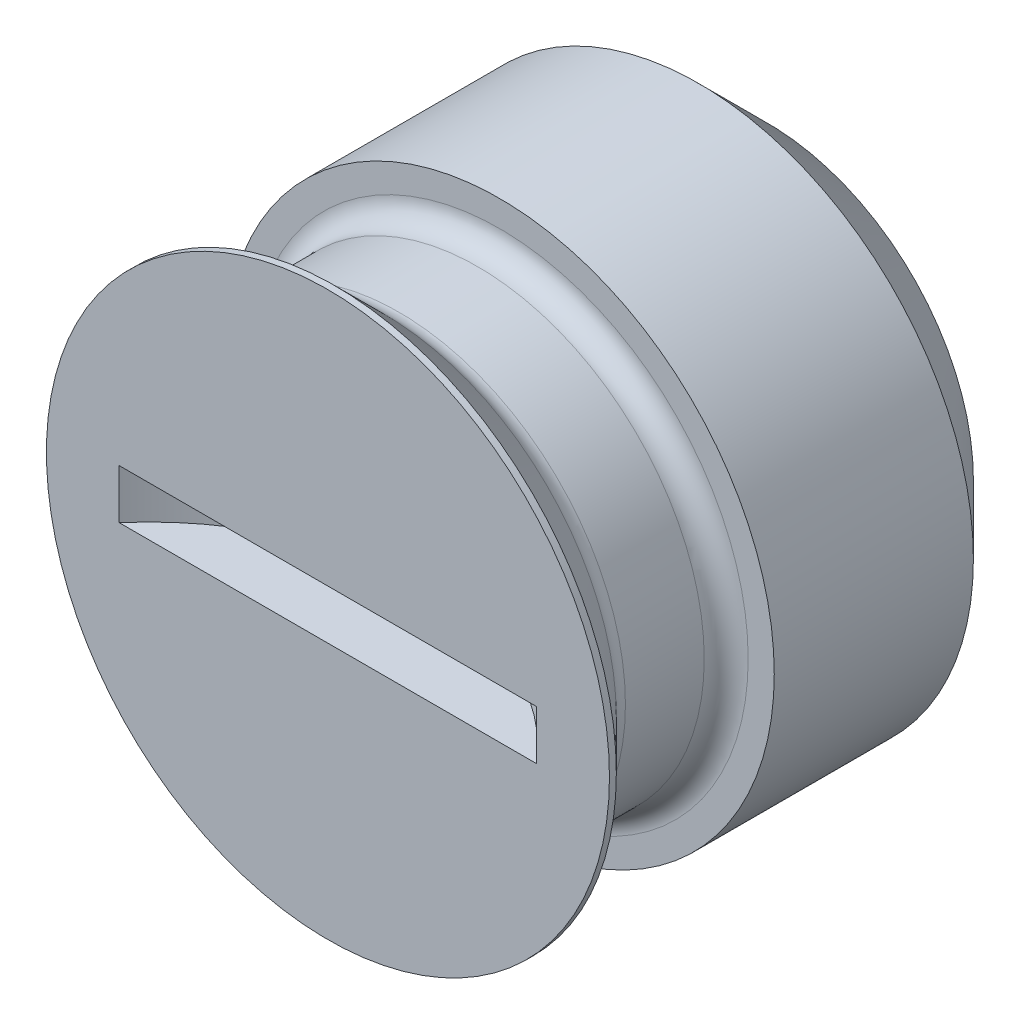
ISO-10303-21;
HEADER;
FILE_DESCRIPTION(('STEP AP214'),'2;1');
FILE_NAME('part.step','',(''),(''),'','','');
FILE_SCHEMA(('AUTOMOTIVE_DESIGN { 1 0 10303 214 1 1 1 1 }'));
ENDSEC;
DATA;
#1=APPLICATION_CONTEXT('core data for automotive mechanical design processes');
#2=APPLICATION_PROTOCOL_DEFINITION('international standard','automotive_design',2000,#1);
#3=PRODUCT_CONTEXT('',#1,'mechanical');
#4=PRODUCT('Part','Part','',(#3));
#5=PRODUCT_RELATED_PRODUCT_CATEGORY('part','',(#4));
#6=PRODUCT_DEFINITION_FORMATION('','',#4);
#7=PRODUCT_DEFINITION_CONTEXT('part definition',#1,'design');
#8=PRODUCT_DEFINITION('design','',#6,#7);
#9=PRODUCT_DEFINITION_SHAPE('','',#8);
#10=(LENGTH_UNIT() NAMED_UNIT(*) SI_UNIT(.MILLI.,.METRE.));
#11=(NAMED_UNIT(*) PLANE_ANGLE_UNIT() SI_UNIT($,.RADIAN.));
#12=(NAMED_UNIT(*) SI_UNIT($,.STERADIAN.) SOLID_ANGLE_UNIT());
#13=UNCERTAINTY_MEASURE_WITH_UNIT(LENGTH_MEASURE(1.E-05),#10,'distance_accuracy_value','');
#14=(GEOMETRIC_REPRESENTATION_CONTEXT(3) GLOBAL_UNCERTAINTY_ASSIGNED_CONTEXT((#13)) GLOBAL_UNIT_ASSIGNED_CONTEXT((#10,
#11,#12)) REPRESENTATION_CONTEXT('',''));
#15=CARTESIAN_POINT('',(0.,0.,0.));
#16=DIRECTION('',(0.,0.,1.));
#17=DIRECTION('',(1.,0.,0.));
#18=AXIS2_PLACEMENT_3D('',#15,#16,#17);
#19=CARTESIAN_POINT('',(0.,10.25,0.));
#20=DIRECTION('',(0.,0.,-1.));
#21=DIRECTION('',(-1.,0.,0.));
#22=AXIS2_PLACEMENT_3D('',#19,#20,#21);
#23=PLANE('',#22);
#24=CARTESIAN_POINT('',(0.,0.,0.));
#25=DIRECTION('',(0.,0.,1.));
#26=DIRECTION('',(1.,0.,0.));
#27=AXIS2_PLACEMENT_3D('',#24,#25,#26);
#28=CIRCLE('',#27,10.25);
#29=CARTESIAN_POINT('',(10.25,0.,0.));
#30=VERTEX_POINT('',#29);
#31=EDGE_CURVE('E76',#30,#30,#28,.T.);
#32=ORIENTED_EDGE('',*,*,#31,.T.);
#33=EDGE_LOOP('',(#32));
#34=FACE_BOUND('',#33,.T.);
#35=DIRECTION('',(1.,0.,0.));
#36=VECTOR('',#35,1.);
#37=CARTESIAN_POINT('',(0.,-0.9,0.));
#38=LINE('',#37,#36);
#39=CARTESIAN_POINT('',(-7.59934207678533,-0.9,0.));
#40=VERTEX_POINT('',#39);
#41=CARTESIAN_POINT('',(7.59934207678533,-0.9,0.));
#42=VERTEX_POINT('',#41);
#43=EDGE_CURVE('E9',#40,#42,#38,.T.);
#44=ORIENTED_EDGE('',*,*,#43,.F.);
#45=DIRECTION('',(0.,1.,0.));
#46=VECTOR('',#45,1.);
#47=CARTESIAN_POINT('',(-7.59934207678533,-0.9,0.));
#48=LINE('',#47,#46);
#49=CARTESIAN_POINT('',(-7.59934207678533,0.9,0.));
#50=VERTEX_POINT('',#49);
#51=EDGE_CURVE('E22',#40,#50,#48,.T.);
#52=ORIENTED_EDGE('',*,*,#51,.T.);
#53=DIRECTION('',(1.,0.,0.));
#54=VECTOR('',#53,1.);
#55=CARTESIAN_POINT('',(0.,0.9,0.));
#56=LINE('',#55,#54);
#57=CARTESIAN_POINT('',(7.59934207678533,0.9,0.));
#58=VERTEX_POINT('',#57);
#59=EDGE_CURVE('E40',#50,#58,#56,.T.);
#60=ORIENTED_EDGE('',*,*,#59,.T.);
#61=DIRECTION('',(0.,1.,0.));
#62=VECTOR('',#61,1.);
#63=CARTESIAN_POINT('',(7.59934207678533,-0.9,0.));
#64=LINE('',#63,#62);
#65=EDGE_CURVE('E44',#58,#42,#64,.F.);
#66=ORIENTED_EDGE('',*,*,#65,.T.);
#67=EDGE_LOOP('',(#44,#52,#60,#66));
#68=FACE_BOUND('',#67,.T.);
#69=ADVANCED_FACE('F14',(#34,#68),#23,.F.);
#70=CARTESIAN_POINT('',(0.,0.,-16.));
#71=DIRECTION('',(0.,0.,1.));
#72=DIRECTION('',(1.,0.,0.));
#73=AXIS2_PLACEMENT_3D('',#70,#71,#72);
#74=PLANE('',#73);
#75=CARTESIAN_POINT('',(0.,0.,-16.));
#76=DIRECTION('',(0.,0.,1.));
#77=DIRECTION('',(1.,0.,0.));
#78=AXIS2_PLACEMENT_3D('',#75,#76,#77);
#79=CIRCLE('',#78,7.49999999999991);
#80=CARTESIAN_POINT('',(7.49999999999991,0.,-16.));
#81=VERTEX_POINT('',#80);
#82=EDGE_CURVE('E45',#81,#81,#79,.T.);
#83=ORIENTED_EDGE('',*,*,#82,.F.);
#84=EDGE_LOOP('',(#83));
#85=FACE_BOUND('',#84,.T.);
#86=ADVANCED_FACE('F16',(#85),#74,.F.);
#87=CARTESIAN_POINT('',(0.,0.,-16.));
#88=DIRECTION('',(0.,0.,1.));
#89=DIRECTION('',(1.,0.,0.));
#90=AXIS2_PLACEMENT_3D('',#87,#88,#89);
#91=CONICAL_SURFACE('',#90,7.49999999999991,0.785398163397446);
#92=CARTESIAN_POINT('',(0.,0.,-13.5));
#93=DIRECTION('',(0.,0.,1.));
#94=DIRECTION('',(1.,0.,0.));
#95=AXIS2_PLACEMENT_3D('',#92,#93,#94);
#96=CIRCLE('',#95,10.);
#97=CARTESIAN_POINT('',(10.,0.,-13.5));
#98=VERTEX_POINT('',#97);
#99=EDGE_CURVE('E55',#98,#98,#96,.T.);
#100=ORIENTED_EDGE('',*,*,#99,.F.);
#101=EDGE_LOOP('',(#100));
#102=FACE_BOUND('',#101,.T.);
#103=ORIENTED_EDGE('',*,*,#82,.T.);
#104=EDGE_LOOP('',(#103));
#105=FACE_BOUND('',#104,.T.);
#106=ADVANCED_FACE('F99',(#102,#105),#91,.T.);
#107=CARTESIAN_POINT('',(0.,0.,0.));
#108=DIRECTION('',(0.,0.,1.));
#109=DIRECTION('',(1.,0.,0.));
#110=AXIS2_PLACEMENT_3D('',#107,#108,#109);
#111=CYLINDRICAL_SURFACE('',#110,10.);
#112=CARTESIAN_POINT('',(0.,0.,-6.25));
#113=DIRECTION('',(0.,0.,1.));
#114=DIRECTION('',(1.,0.,0.));
#115=AXIS2_PLACEMENT_3D('',#112,#113,#114);
#116=CIRCLE('',#115,10.);
#117=CARTESIAN_POINT('',(10.,0.,-6.25));
#118=VERTEX_POINT('',#117);
#119=EDGE_CURVE('E58',#118,#118,#116,.T.);
#120=ORIENTED_EDGE('',*,*,#119,.F.);
#121=EDGE_LOOP('',(#120));
#122=FACE_BOUND('',#121,.T.);
#123=ORIENTED_EDGE('',*,*,#99,.T.);
#124=EDGE_LOOP('',(#123));
#125=FACE_BOUND('',#124,.T.);
#126=ADVANCED_FACE('F124',(#122,#125),#111,.T.);
#127=CARTESIAN_POINT('',(0.,9.05000000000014,-6.25));
#128=DIRECTION('',(0.,0.,-1.));
#129=DIRECTION('',(-1.,0.,0.));
#130=AXIS2_PLACEMENT_3D('',#127,#128,#129);
#131=PLANE('',#130);
#132=CARTESIAN_POINT('',(0.,0.,-6.25));
#133=DIRECTION('',(0.,0.,1.));
#134=DIRECTION('',(1.,0.,0.));
#135=AXIS2_PLACEMENT_3D('',#132,#133,#134);
#136=CIRCLE('',#135,9.05000000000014);
#137=CARTESIAN_POINT('',(9.05000000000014,0.,-6.25));
#138=VERTEX_POINT('',#137);
#139=EDGE_CURVE('E61',#138,#138,#136,.T.);
#140=ORIENTED_EDGE('',*,*,#139,.F.);
#141=EDGE_LOOP('',(#140));
#142=FACE_BOUND('',#141,.T.);
#143=ORIENTED_EDGE('',*,*,#119,.T.);
#144=EDGE_LOOP('',(#143));
#145=FACE_BOUND('',#144,.T.);
#146=ADVANCED_FACE('F120',(#142,#145),#131,.F.);
#147=CARTESIAN_POINT('',(0.,0.,-5.45));
#148=DIRECTION('',(0.,0.,1.));
#149=DIRECTION('',(1.,0.,0.));
#150=AXIS2_PLACEMENT_3D('',#147,#148,#149);
#151=TOROIDAL_SURFACE('',#150,9.05000000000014,0.8);
#152=CARTESIAN_POINT('',(0.,0.,-5.45000000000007));
#153=DIRECTION('',(0.,0.,1.));
#154=DIRECTION('',(1.,0.,0.));
#155=AXIS2_PLACEMENT_3D('',#152,#153,#154);
#156=CIRCLE('',#155,8.25000000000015);
#157=CARTESIAN_POINT('',(8.25000000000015,0.,-5.45000000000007));
#158=VERTEX_POINT('',#157);
#159=EDGE_CURVE('E64',#158,#158,#156,.T.);
#160=ORIENTED_EDGE('',*,*,#159,.F.);
#161=EDGE_LOOP('',(#160));
#162=FACE_BOUND('',#161,.T.);
#163=ORIENTED_EDGE('',*,*,#139,.T.);
#164=EDGE_LOOP('',(#163));
#165=FACE_BOUND('',#164,.T.);
#166=ADVANCED_FACE('F116',(#162,#165),#151,.F.);
#167=CARTESIAN_POINT('',(0.,0.,0.));
#168=DIRECTION('',(0.,0.,1.));
#169=DIRECTION('',(1.,0.,0.));
#170=AXIS2_PLACEMENT_3D('',#167,#168,#169);
#171=CYLINDRICAL_SURFACE('',#170,8.25000000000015);
#172=CARTESIAN_POINT('',(0.,0.,-2.58137084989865));
#173=DIRECTION('',(0.,0.,1.));
#174=DIRECTION('',(1.,0.,0.));
#175=AXIS2_PLACEMENT_3D('',#172,#173,#174);
#176=CIRCLE('',#175,8.25000000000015);
#177=CARTESIAN_POINT('',(8.25000000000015,0.,-2.58137084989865));
#178=VERTEX_POINT('',#177);
#179=EDGE_CURVE('E67',#178,#178,#176,.T.);
#180=ORIENTED_EDGE('',*,*,#179,.F.);
#181=EDGE_LOOP('',(#180));
#182=FACE_BOUND('',#181,.T.);
#183=ORIENTED_EDGE('',*,*,#159,.T.);
#184=EDGE_LOOP('',(#183));
#185=FACE_BOUND('',#184,.T.);
#186=ADVANCED_FACE('F112',(#182,#185),#171,.T.);
#187=CARTESIAN_POINT('',(0.,0.,-2.58137084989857));
#188=DIRECTION('',(0.,0.,1.));
#189=DIRECTION('',(1.,0.,0.));
#190=AXIS2_PLACEMENT_3D('',#187,#188,#189);
#191=TOROIDAL_SURFACE('',#190,9.05000000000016,0.8);
#192=CARTESIAN_POINT('',(0.,0.,-2.01568542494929));
#193=DIRECTION('',(0.,0.,1.));
#194=DIRECTION('',(1.,0.,0.));
#195=AXIS2_PLACEMENT_3D('',#192,#193,#194);
#196=CIRCLE('',#195,8.48431457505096);
#197=CARTESIAN_POINT('',(8.48431457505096,0.,-2.01568542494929));
#198=VERTEX_POINT('',#197);
#199=EDGE_CURVE('E70',#198,#198,#196,.T.);
#200=ORIENTED_EDGE('',*,*,#199,.F.);
#201=EDGE_LOOP('',(#200));
#202=FACE_BOUND('',#201,.T.);
#203=ORIENTED_EDGE('',*,*,#179,.T.);
#204=EDGE_LOOP('',(#203));
#205=FACE_BOUND('',#204,.T.);
#206=ADVANCED_FACE('F108',(#202,#205),#191,.F.);
#207=CARTESIAN_POINT('',(0.,0.,-2.01568542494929));
#208=DIRECTION('',(0.,0.,1.));
#209=DIRECTION('',(1.,0.,0.));
#210=AXIS2_PLACEMENT_3D('',#207,#208,#209);
#211=CONICAL_SURFACE('',#210,8.48431457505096,0.785398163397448);
#212=CARTESIAN_POINT('',(0.,0.,-0.250000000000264));
#213=DIRECTION('',(0.,0.,1.));
#214=DIRECTION('',(1.,0.,0.));
#215=AXIS2_PLACEMENT_3D('',#212,#213,#214);
#216=CIRCLE('',#215,10.25);
#217=CARTESIAN_POINT('',(10.25,0.,-0.250000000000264));
#218=VERTEX_POINT('',#217);
#219=EDGE_CURVE('E73',#218,#218,#216,.T.);
#220=ORIENTED_EDGE('',*,*,#219,.F.);
#221=EDGE_LOOP('',(#220));
#222=FACE_BOUND('',#221,.T.);
#223=ORIENTED_EDGE('',*,*,#199,.T.);
#224=EDGE_LOOP('',(#223));
#225=FACE_BOUND('',#224,.T.);
#226=ADVANCED_FACE('F104',(#222,#225),#211,.T.);
#227=CARTESIAN_POINT('',(0.,0.,0.));
#228=DIRECTION('',(0.,0.,1.));
#229=DIRECTION('',(1.,0.,0.));
#230=AXIS2_PLACEMENT_3D('',#227,#228,#229);
#231=CYLINDRICAL_SURFACE('',#230,10.25);
#232=ORIENTED_EDGE('',*,*,#31,.F.);
#233=EDGE_LOOP('',(#232));
#234=FACE_BOUND('',#233,.T.);
#235=ORIENTED_EDGE('',*,*,#219,.T.);
#236=EDGE_LOOP('',(#235));
#237=FACE_BOUND('',#236,.T.);
#238=ADVANCED_FACE('F90',(#234,#237),#231,.T.);
#239=CARTESIAN_POINT('',(0.,-0.9,6.5));
#240=DIRECTION('',(0.,1.,0.));
#241=DIRECTION('',(1.,0.,0.));
#242=AXIS2_PLACEMENT_3D('',#239,#240,#241);
#243=CYLINDRICAL_SURFACE('',#242,10.);
#244=CARTESIAN_POINT('',(0.,-0.9,6.5));
#245=DIRECTION('',(0.,1.,0.));
#246=DIRECTION('',(1.,0.,0.));
#247=AXIS2_PLACEMENT_3D('',#244,#245,#246);
#248=CIRCLE('',#247,10.);
#249=EDGE_CURVE('E48',#42,#40,#248,.T.);
#250=ORIENTED_EDGE('',*,*,#249,.F.);
#251=ORIENTED_EDGE('',*,*,#65,.F.);
#252=CARTESIAN_POINT('',(0.,0.9,6.5));
#253=DIRECTION('',(0.,1.,0.));
#254=DIRECTION('',(1.,0.,0.));
#255=AXIS2_PLACEMENT_3D('',#252,#253,#254);
#256=CIRCLE('',#255,10.);
#257=EDGE_CURVE('E28',#58,#50,#256,.T.);
#258=ORIENTED_EDGE('',*,*,#257,.T.);
#259=ORIENTED_EDGE('',*,*,#51,.F.);
#260=EDGE_LOOP('',(#250,#251,#258,#259));
#261=FACE_BOUND('',#260,.T.);
#262=ADVANCED_FACE('F47',(#261),#243,.F.);
#263=CARTESIAN_POINT('',(0.,-0.9,6.5));
#264=DIRECTION('',(0.,1.,0.));
#265=DIRECTION('',(1.,0.,0.));
#266=AXIS2_PLACEMENT_3D('',#263,#264,#265);
#267=PLANE('',#266);
#268=ORIENTED_EDGE('',*,*,#43,.T.);
#269=ORIENTED_EDGE('',*,*,#249,.T.);
#270=EDGE_LOOP('',(#268,#269));
#271=FACE_BOUND('',#270,.T.);
#272=ADVANCED_FACE('F80',(#271),#267,.T.);
#273=CARTESIAN_POINT('',(0.,0.9,6.5));
#274=DIRECTION('',(0.,1.,0.));
#275=DIRECTION('',(1.,0.,0.));
#276=AXIS2_PLACEMENT_3D('',#273,#274,#275);
#277=PLANE('',#276);
#278=ORIENTED_EDGE('',*,*,#257,.F.);
#279=ORIENTED_EDGE('',*,*,#59,.F.);
#280=EDGE_LOOP('',(#278,#279));
#281=FACE_BOUND('',#280,.T.);
#282=ADVANCED_FACE('F41',(#281),#277,.F.);
#283=CLOSED_SHELL('',(#69,#86,#106,#126,#146,#166,#186,#206,#226,#238,#262,#272,#282));
#284=MANIFOLD_SOLID_BREP('B1',#283);
#285=ADVANCED_BREP_SHAPE_REPRESENTATION('',(#18,#284),#14);
#286=SHAPE_DEFINITION_REPRESENTATION(#9,#285);
ENDSEC;
END-ISO-10303-21;
